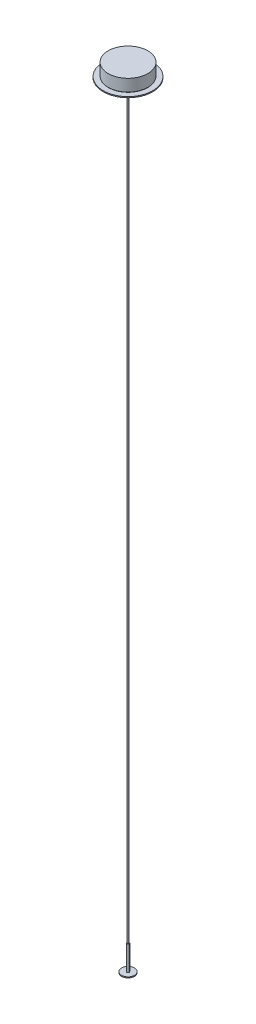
from build123d import *

# Parameters (mm, degrees)
CROQUIS114_R            = 40
SALIENTE_EXTRUIR1_DEPTH = 25
REDONDEO1_R             = 1
CROQUIS115_R            = 50
SALIENTE_EXTRUIR2_DEPTH = 2
CROQUIS122_R            = 6
SALIENTE_EXTRUIR3_DEPTH = 15
CROQUIS123_R            = 1.5
SALIENTE_EXTRUIR4_DEPTH = 1500
CROQUIS124_R            = 2.5
SALIENTE_EXTRUIR5_DEPTH = 50
CROQUIS125_R            = 13
SALIENTE_EXTRUIR6_DEPTH = 2


with BuildPart() as part:
    # Croquis114 → Saliente-Extruir1 (new body)
    with BuildSketch(Plane(origin=(0, 0, 0), x_dir=(0, 0, -1), z_dir=(0, 1, 0))):
        with Locations(Location((0, 0, 0), (0, 0, 180))):
            Circle(CROQUIS114_R)
    extrude(amount=SALIENTE_EXTRUIR1_DEPTH)

    # Redondeo1
    redondeo1_edges = [part.edges().sort_by_distance(p)[0] for p in [
        (0, 0, -40),
    ]]
    fillet(redondeo1_edges, radius=REDONDEO1_R)

    # Croquis115 → Saliente-Extruir2 (add)
    with BuildSketch(Plane(origin=(0, 0, 0), x_dir=(0, 0, 1), z_dir=(0, -1, 0))):
        with Locations(Location((0, 0, 0), (0, 0, 180))):
            Circle(CROQUIS115_R)
    extrude(amount=SALIENTE_EXTRUIR2_DEPTH)


with BuildPart() as body_2:
    # Croquis122 → Saliente-Extruir3 (new body)
    with BuildSketch(Plane(origin=(0, -2, 0), x_dir=(0, 0, 1), z_dir=(0, -1, 0))):
        with Locations(Location((0, 0, 0), (0, 0, 180))):
            Circle(CROQUIS122_R)
    extrude(amount=SALIENTE_EXTRUIR3_DEPTH)


with BuildPart() as body_3:
    # Croquis123 → Saliente-Extruir4 (new body)
    with BuildSketch(Plane(origin=(0, -17, 0), x_dir=(0, 0, 1), z_dir=(0, -1, 0))):
        with Locations(Location((0, 0, 0), (0, 0, 180))):
            Circle(CROQUIS123_R)
    extrude(amount=SALIENTE_EXTRUIR4_DEPTH)


with BuildPart() as body_4:
    # Croquis124 → Saliente-Extruir5 (new body)
    with BuildSketch(Plane(origin=(0, -1517, 0), x_dir=(0, 0, 1), z_dir=(0, -1, 0))):
        with Locations(Location((0, 0, 0), (0, 0, 180))):
            Circle(CROQUIS124_R)
    extrude(amount=SALIENTE_EXTRUIR5_DEPTH)

    # Croquis125 → Saliente-Extruir6 (add)
    with BuildSketch(Plane(origin=(0, -1567, 0), x_dir=(0, 0, 1), z_dir=(0, -1, 0))):
        with Locations(Location((0, 0, 0), (0, 0, 180))):
            Circle(CROQUIS125_R)
    extrude(amount=SALIENTE_EXTRUIR6_DEPTH)


solid = Compound([part.part, body_2.part, body_3.part, body_4.part])
